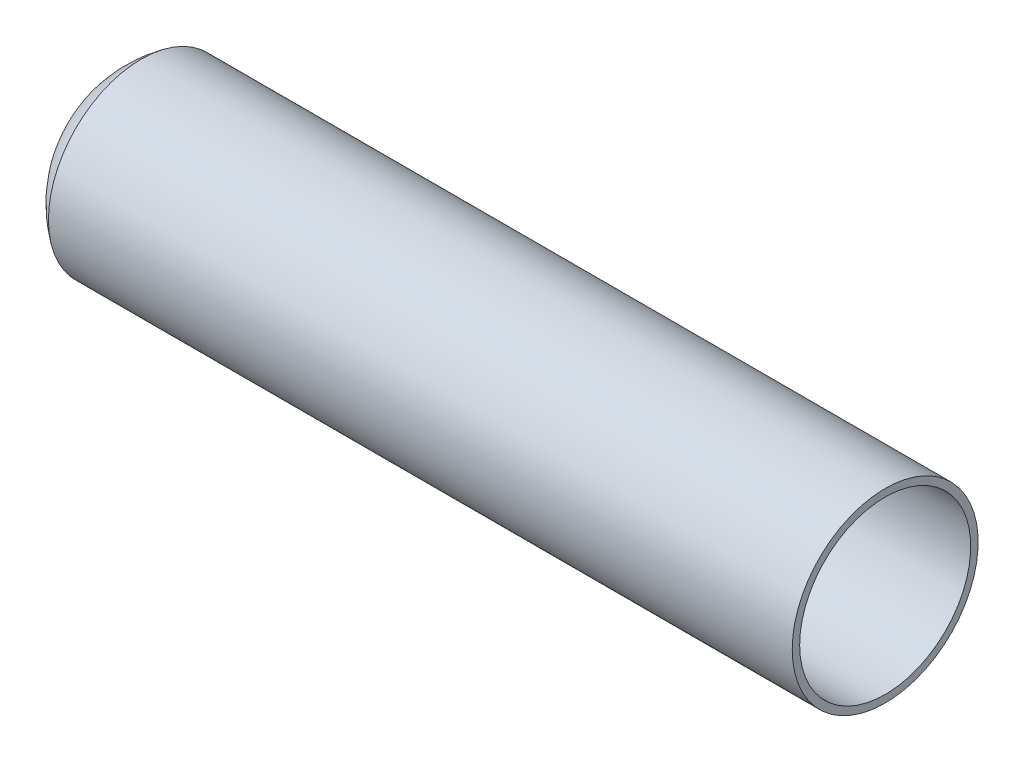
from build123d import *


with BuildPart() as part:
    # Esquisse2 → Base-R_vol.-Mince (revolve)
    with BuildSketch(Plane.XY, mode=Mode.PRIVATE) as base_r_vol_mince_sk:
        with BuildLine():
            Line((14.2, 0), (14.2, 11))
            ThreePointArc((14.2, 11), (18.654416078, 18.821530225), (25.2, 25))
            Line((25.2, 25), (225.2, 25))
            Line((225.2, 25), (225.2, 23))
            Line((225.2, 23), (25.839503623, 23))
            ThreePointArc((25.839503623, 23), (20.149855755, 17.487189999), (16.2, 10.619744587))
            Line((16.2, 10.619744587), (16.2, 0))
            Line((16.2, 0), (14.2, 0))
        make_face()
    revolve(base_r_vol_mince_sk.sketch.rotate(Axis((14.2, 0, 0), (1, 0, 0)), 90), axis=Axis((14.2, 0, 0), (1, 0, 0)))


solid = part.part
